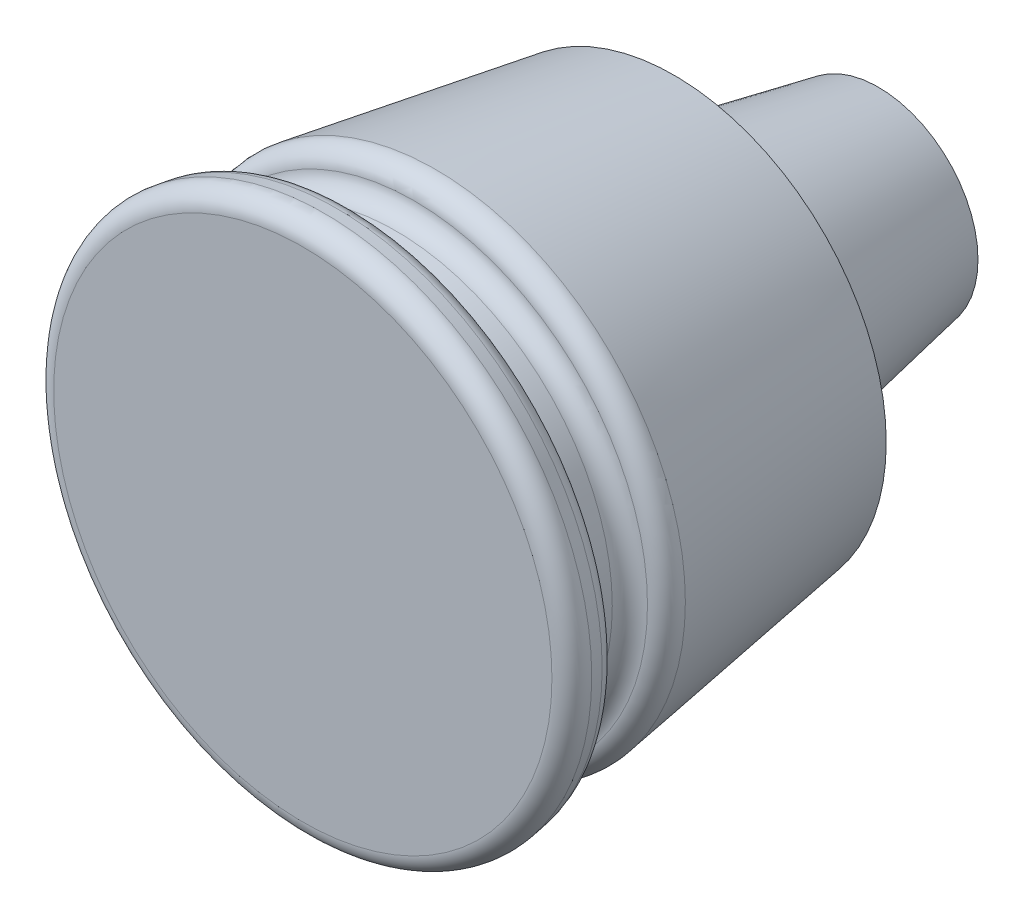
from build123d import *

# Parameters (mm, degrees)
ESQUISSE1_R        = 22.5
BOSS_EXTRU_1_DEPTH = 33
BOSS_EXTRU_1_DRAFT = -11
ESQUISSE2_R        = 34.259042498
BOSS_EXTRU_2_DEPTH = 60
BOSS_EXTRU_2_DRAFT = -9
CONG_1_R           = 3


with BuildPart() as part:
    # Esquisse1 → Boss.-Extru.1 (with draft: the straight prism first)
    with BuildSketch(Plane.XY):
        Circle(ESQUISSE1_R)
    extrude(amount=-BOSS_EXTRU_1_DEPTH)
    # Boss.-Extru.1: the draft: its side faces are tilted about the plane it starts from
    boss_extru_1_sides = [part.faces().sort_by_distance(p)[0] for p in [
        (-22.5, 0, -16.5),
    ]]
    draft(boss_extru_1_sides, Plane.XY, BOSS_EXTRU_1_DRAFT)


with BuildPart() as boss_extru_2_tool:
    # Esquisse2 → Boss.-Extru.2 (with draft: the straight prism first)
    with BuildSketch(Plane.XY):
        Circle(ESQUISSE2_R)
    extrude(amount=BOSS_EXTRU_2_DEPTH)
    # Boss.-Extru.2: the draft: its side faces are tilted about the plane it starts from
    boss_extru_2_sides = [boss_extru_2_tool.faces().sort_by_distance(p)[0] for p in [
        (-34.259042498, 0, 30),
    ]]
    draft(boss_extru_2_sides, Plane.XY, BOSS_EXTRU_2_DRAFT)


with BuildPart() as part_1:
    add(part.part)

    # Boss.-Extru.2: add boss_extru_2_tool
    add(boss_extru_2_tool.part)

    # Esquisse3 → Enl_vement de mati_re-R_volution1 (revolve, cut)
    with BuildSketch(Plane(origin=(0, 0, 0), x_dir=(0, 0, -1), z_dir=(1, 0, 0)), mode=Mode.PRIVATE) as enl_vement_de_mati_re_r_volution1_sk:
        with BuildLine():
            Line((-45, -35), (-49, -35))
            ThreePointArc((-49, -35), (-51.121320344, -35.878679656), (-52, -38))
            Line((-52, -38), (-52, -51))
            Line((-52, -51), (-42, -51))
            Line((-42, -51), (-42, -38))
            ThreePointArc((-42, -38), (-42.878679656, -35.878679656), (-45, -35))
        make_face()
    revolve(enl_vement_de_mati_re_r_volution1_sk.sketch.rotate(Axis((0, 0, 0), (0, 0, 1)), 270), axis=Axis((0, 0, 0), (0, 0, 1)), mode=Mode.SUBTRACT)

    # Cong_1
    cong_1_edges = [part_1.edges().sort_by_distance(p)[0] for p in [
        (-40.911188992, 0, 42),
        (-42.495033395, 0, 52),
        (-43.762108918, 0, 60),
    ]]
    fillet(cong_1_edges, radius=CONG_1_R)


solid = part_1.part
